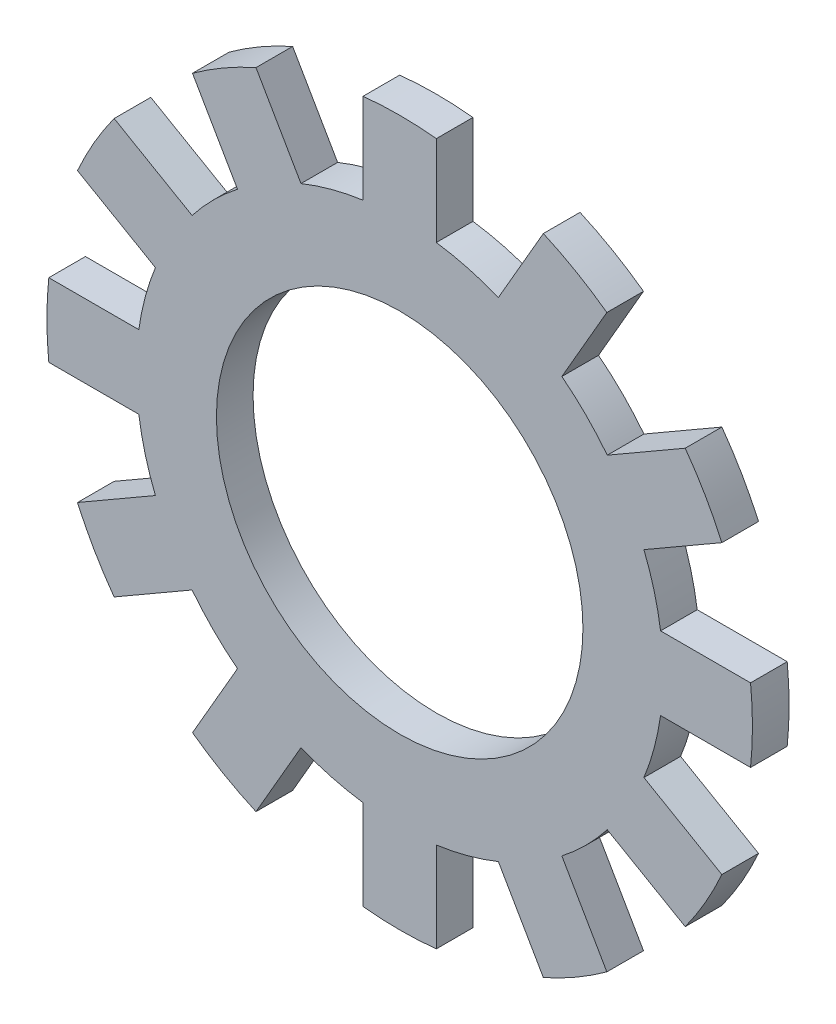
from build123d import *

# Parameters (mm, degrees)
SKETCH1_R                 = 5.75
SKETCH1_R_2               = 4
BOSS_EXTRUDE1_DEPTH       = 0.4
BOSS_EXTRUDE2_DEPTH       = 0.4
CIRPATTERN2_COUNT         = 12
CIRPATTERN2_COPY_1_DEPTH  = 0.4
CIRPATTERN2_COPY_2_DEPTH  = 0.4
CIRPATTERN2_COPY_3_DEPTH  = 0.4
CIRPATTERN2_COPY_4_DEPTH  = 0.4
CIRPATTERN2_COPY_5_DEPTH  = 0.4
CIRPATTERN2_COPY_6_DEPTH  = 0.4
CIRPATTERN2_COPY_7_DEPTH  = 0.4
CIRPATTERN2_COPY_8_DEPTH  = 0.4
CIRPATTERN2_COPY_9_DEPTH  = 0.4
CIRPATTERN2_COPY_10_DEPTH = 0.4
CIRPATTERN2_COPY_11_DEPTH = 0.4


with BuildPart() as part:
    # Sketch1 → Boss-Extrude1 (new, symmetric)
    with BuildSketch(Plane.XY):
        Circle(SKETCH1_R)
        Circle(SKETCH1_R_2, mode=Mode.SUBTRACT)
    extrude(amount=BOSS_EXTRUDE1_DEPTH, both=True)

    # Sketch3 → Boss-Extrude2 (add, symmetric)
    with BuildSketch(Plane.XY):
        with BuildLine():
            Line((-0.8, 7.658328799), (-0.8, 5.694075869))
            ThreePointArc((-0.8, 5.694075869), (-0.400976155, 5.736001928), (0, 5.75))
            Line((0, 5.75), (0, 7.7))
            ThreePointArc((0, 7.7), (-0.400542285, 7.689575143), (-0.8, 7.658328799))
        make_face()
    boss_extrude2 = extrude(amount=BOSS_EXTRUDE2_DEPTH, both=True)

    # Mirror1: Boss-Extrude2 across plane
    add(boss_extrude2.mirror(Plane(origin=(0, 0, 0), x_dir=(0, 0, 1), z_dir=(1, 0, 0))))

    # CirPattern2: Boss-Extrude2 ×12 about axis
    cirpattern2_axis = Axis((0, 0, 0), (0, 0, 1))
    for i in range(1, CIRPATTERN2_COUNT):
        add(boss_extrude2.rotate(cirpattern2_axis, i * 360 / CIRPATTERN2_COUNT))

    # CirPattern2 copy 1 sketch → CirPattern2 copy 1 (add, symmetric)
    with BuildSketch(Plane(origin=(0, 0, 0), x_dir=(-0.8660254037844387, -0.49999999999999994, 0), z_dir=(0, 0, 1))):
        with BuildLine():
            Line((-0.8, -7.658328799), (-0.8, -5.694075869))
            ThreePointArc((-0.8, -5.694075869), (-0.400976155, -5.736001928), (0, -5.75))
            Line((0, -5.75), (0, -7.7))
            ThreePointArc((0, -7.7), (-0.400542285, -7.689575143), (-0.8, -7.658328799))
        make_face()
    extrude(amount=CIRPATTERN2_COPY_1_DEPTH, both=True)

    # CirPattern2 copy 2 sketch → CirPattern2 copy 2 (add, symmetric)
    with BuildSketch(Plane(origin=(0, 0, 0), x_dir=(-0.5000000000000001, -0.8660254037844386, 0), z_dir=(0, 0, 1))):
        with BuildLine():
            Line((-0.8, -7.658328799), (-0.8, -5.694075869))
            ThreePointArc((-0.8, -5.694075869), (-0.400976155, -5.736001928), (0, -5.75))
            Line((0, -5.75), (0, -7.7))
            ThreePointArc((0, -7.7), (-0.400542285, -7.689575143), (-0.8, -7.658328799))
        make_face()
    extrude(amount=CIRPATTERN2_COPY_2_DEPTH, both=True)

    # CirPattern2 copy 3 sketch → CirPattern2 copy 3 (add, symmetric)
    with BuildSketch(Plane(origin=(0, 0, 0), x_dir=(0, -1, 0), z_dir=(0, 0, 1))):
        with BuildLine():
            Line((-0.8, -7.658328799), (-0.8, -5.694075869))
            ThreePointArc((-0.8, -5.694075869), (-0.400976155, -5.736001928), (0, -5.75))
            Line((0, -5.75), (0, -7.7))
            ThreePointArc((0, -7.7), (-0.400542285, -7.689575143), (-0.8, -7.658328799))
        make_face()
    extrude(amount=CIRPATTERN2_COPY_3_DEPTH, both=True)

    # CirPattern2 copy 4 sketch → CirPattern2 copy 4 (add, symmetric)
    with BuildSketch(Plane(origin=(0, 0, 0), x_dir=(0.4999999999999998, -0.8660254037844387, 0), z_dir=(0, 0, 1))):
        with BuildLine():
            Line((-0.8, -7.658328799), (-0.8, -5.694075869))
            ThreePointArc((-0.8, -5.694075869), (-0.400976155, -5.736001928), (0, -5.75))
            Line((0, -5.75), (0, -7.7))
            ThreePointArc((0, -7.7), (-0.400542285, -7.689575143), (-0.8, -7.658328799))
        make_face()
    extrude(amount=CIRPATTERN2_COPY_4_DEPTH, both=True)

    # CirPattern2 copy 5 sketch → CirPattern2 copy 5 (add, symmetric)
    with BuildSketch(Plane(origin=(0, 0, 0), x_dir=(0.8660254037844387, -0.49999999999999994, 0), z_dir=(0, 0, 1))):
        with BuildLine():
            Line((-0.8, -7.658328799), (-0.8, -5.694075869))
            ThreePointArc((-0.8, -5.694075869), (-0.400976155, -5.736001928), (0, -5.75))
            Line((0, -5.75), (0, -7.7))
            ThreePointArc((0, -7.7), (-0.400542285, -7.689575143), (-0.8, -7.658328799))
        make_face()
    extrude(amount=CIRPATTERN2_COPY_5_DEPTH, both=True)

    # CirPattern2 copy 6 sketch → CirPattern2 copy 6 (add, symmetric)
    with BuildSketch(Plane.XY):
        with BuildLine():
            Line((-0.8, -7.658328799), (-0.8, -5.694075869))
            ThreePointArc((-0.8, -5.694075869), (-0.400976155, -5.736001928), (0, -5.75))
            Line((0, -5.75), (0, -7.7))
            ThreePointArc((0, -7.7), (-0.400542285, -7.689575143), (-0.8, -7.658328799))
        make_face()
    extrude(amount=CIRPATTERN2_COPY_6_DEPTH, both=True)

    # CirPattern2 copy 7 sketch → CirPattern2 copy 7 (add, symmetric)
    with BuildSketch(Plane(origin=(0, 0, 0), x_dir=(0.8660254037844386, 0.5000000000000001, 0), z_dir=(0, 0, 1))):
        with BuildLine():
            Line((-0.8, -7.658328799), (-0.8, -5.694075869))
            ThreePointArc((-0.8, -5.694075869), (-0.400976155, -5.736001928), (0, -5.75))
            Line((0, -5.75), (0, -7.7))
            ThreePointArc((0, -7.7), (-0.400542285, -7.689575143), (-0.8, -7.658328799))
        make_face()
    extrude(amount=CIRPATTERN2_COPY_7_DEPTH, both=True)

    # CirPattern2 copy 8 sketch → CirPattern2 copy 8 (add, symmetric)
    with BuildSketch(Plane(origin=(0, 0, 0), x_dir=(0.5000000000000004, 0.8660254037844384, 0), z_dir=(0, 0, 1))):
        with BuildLine():
            Line((-0.8, -7.658328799), (-0.8, -5.694075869))
            ThreePointArc((-0.8, -5.694075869), (-0.400976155, -5.736001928), (0, -5.75))
            Line((0, -5.75), (0, -7.7))
            ThreePointArc((0, -7.7), (-0.400542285, -7.689575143), (-0.8, -7.658328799))
        make_face()
    extrude(amount=CIRPATTERN2_COPY_8_DEPTH, both=True)

    # CirPattern2 copy 9 sketch → CirPattern2 copy 9 (add, symmetric)
    with BuildSketch(Plane(origin=(0, 0, 0), x_dir=(0, 1, 0), z_dir=(0, 0, 1))):
        with BuildLine():
            Line((-0.8, -7.658328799), (-0.8, -5.694075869))
            ThreePointArc((-0.8, -5.694075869), (-0.400976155, -5.736001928), (0, -5.75))
            Line((0, -5.75), (0, -7.7))
            ThreePointArc((0, -7.7), (-0.400542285, -7.689575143), (-0.8, -7.658328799))
        make_face()
    extrude(amount=CIRPATTERN2_COPY_9_DEPTH, both=True)

    # CirPattern2 copy 10 sketch → CirPattern2 copy 10 (add, symmetric)
    with BuildSketch(Plane(origin=(0, 0, 0), x_dir=(-0.5000000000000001, 0.8660254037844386, 0), z_dir=(0, 0, 1))):
        with BuildLine():
            Line((-0.8, -7.658328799), (-0.8, -5.694075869))
            ThreePointArc((-0.8, -5.694075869), (-0.400976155, -5.736001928), (0, -5.75))
            Line((0, -5.75), (0, -7.7))
            ThreePointArc((0, -7.7), (-0.400542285, -7.689575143), (-0.8, -7.658328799))
        make_face()
    extrude(amount=CIRPATTERN2_COPY_10_DEPTH, both=True)

    # CirPattern2 copy 11 sketch → CirPattern2 copy 11 (add, symmetric)
    with BuildSketch(Plane(origin=(0, 0, 0), x_dir=(-0.8660254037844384, 0.5000000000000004, 0), z_dir=(0, 0, 1))):
        with BuildLine():
            Line((-0.8, -7.658328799), (-0.8, -5.694075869))
            ThreePointArc((-0.8, -5.694075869), (-0.400976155, -5.736001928), (0, -5.75))
            Line((0, -5.75), (0, -7.7))
            ThreePointArc((0, -7.7), (-0.400542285, -7.689575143), (-0.8, -7.658328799))
        make_face()
    extrude(amount=CIRPATTERN2_COPY_11_DEPTH, both=True)


solid = part.part
